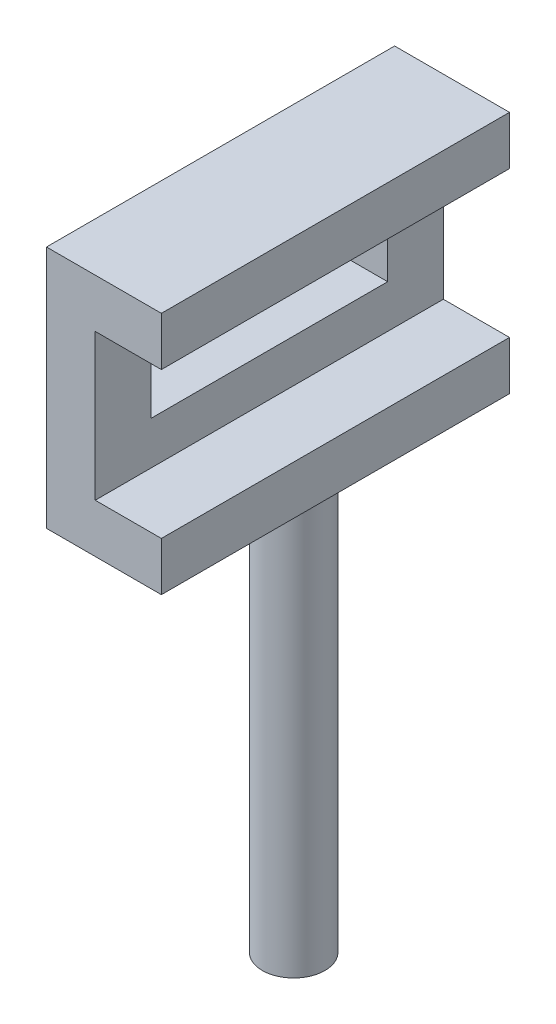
ISO-10303-21;
HEADER;
FILE_DESCRIPTION(('STEP AP214'),'2;1');
FILE_NAME('part.step','',(''),(''),'','','');
FILE_SCHEMA(('AUTOMOTIVE_DESIGN { 1 0 10303 214 1 1 1 1 }'));
ENDSEC;
DATA;
#1=APPLICATION_CONTEXT('core data for automotive mechanical design processes');
#2=APPLICATION_PROTOCOL_DEFINITION('international standard','automotive_design',2000,#1);
#3=PRODUCT_CONTEXT('',#1,'mechanical');
#4=PRODUCT('Part','Part','',(#3));
#5=PRODUCT_RELATED_PRODUCT_CATEGORY('part','',(#4));
#6=PRODUCT_DEFINITION_FORMATION('','',#4);
#7=PRODUCT_DEFINITION_CONTEXT('part definition',#1,'design');
#8=PRODUCT_DEFINITION('design','',#6,#7);
#9=PRODUCT_DEFINITION_SHAPE('','',#8);
#10=(LENGTH_UNIT() NAMED_UNIT(*) SI_UNIT(.MILLI.,.METRE.));
#11=(NAMED_UNIT(*) PLANE_ANGLE_UNIT() SI_UNIT($,.RADIAN.));
#12=(NAMED_UNIT(*) SI_UNIT($,.STERADIAN.) SOLID_ANGLE_UNIT());
#13=UNCERTAINTY_MEASURE_WITH_UNIT(LENGTH_MEASURE(1.E-05),#10,'distance_accuracy_value','');
#14=(GEOMETRIC_REPRESENTATION_CONTEXT(3) GLOBAL_UNCERTAINTY_ASSIGNED_CONTEXT((#13)) GLOBAL_UNIT_ASSIGNED_CONTEXT((#10,
#11,#12)) REPRESENTATION_CONTEXT('',''));
#15=CARTESIAN_POINT('',(0.,0.,0.));
#16=DIRECTION('',(0.,0.,1.));
#17=DIRECTION('',(1.,0.,0.));
#18=AXIS2_PLACEMENT_3D('',#15,#16,#17);
#19=CARTESIAN_POINT('',(-31.3967146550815,-12.2325806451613,50.));
#20=DIRECTION('',(0.,1.,0.));
#21=DIRECTION('',(-1.,0.,0.));
#22=AXIS2_PLACEMENT_3D('',#19,#20,#21);
#23=PLANE('',#22);
#24=DIRECTION('',(1.,0.,0.));
#25=VECTOR('',#24,1.);
#26=CARTESIAN_POINT('',(-31.3967146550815,-12.2325806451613,0.));
#27=LINE('',#26,#25);
#28=CARTESIAN_POINT('',(-47.8967146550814,-12.2325806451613,0.));
#29=VERTEX_POINT('',#28);
#30=CARTESIAN_POINT('',(-31.3967146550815,-12.2325806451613,0.));
#31=VERTEX_POINT('',#30);
#32=EDGE_CURVE('E181',#29,#31,#27,.T.);
#33=ORIENTED_EDGE('',*,*,#32,.T.);
#34=DIRECTION('',(0.,0.,-1.));
#35=VECTOR('',#34,1.);
#36=CARTESIAN_POINT('',(-31.3967146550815,-12.2325806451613,50.));
#37=LINE('',#36,#35);
#38=CARTESIAN_POINT('',(-31.3967146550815,-12.2325806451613,50.));
#39=VERTEX_POINT('',#38);
#40=EDGE_CURVE('E201',#39,#31,#37,.T.);
#41=ORIENTED_EDGE('',*,*,#40,.F.);
#42=DIRECTION('',(1.,0.,0.));
#43=VECTOR('',#42,1.);
#44=CARTESIAN_POINT('',(-31.3967146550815,-12.2325806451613,50.));
#45=LINE('',#44,#43);
#46=CARTESIAN_POINT('',(-47.8967146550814,-12.2325806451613,50.));
#47=VERTEX_POINT('',#46);
#48=EDGE_CURVE('E164',#47,#39,#45,.T.);
#49=ORIENTED_EDGE('',*,*,#48,.F.);
#50=DIRECTION('',(0.,0.,-1.));
#51=VECTOR('',#50,1.);
#52=CARTESIAN_POINT('',(-47.8967146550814,-12.2325806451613,50.));
#53=LINE('',#52,#51);
#54=EDGE_CURVE('E204',#47,#29,#53,.T.);
#55=ORIENTED_EDGE('',*,*,#54,.T.);
#56=EDGE_LOOP('',(#33,#41,#49,#55));
#57=FACE_BOUND('',#56,.T.);
#58=CARTESIAN_POINT('',(-37.3967146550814,-12.2325806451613,25.));
#59=DIRECTION('',(0.,1.,0.));
#60=DIRECTION('',(-1.,0.,0.));
#61=AXIS2_PLACEMENT_3D('',#58,#59,#60);
#62=CIRCLE('',#61,4.5);
#63=CARTESIAN_POINT('',(-41.8967146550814,-12.2325806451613,25.));
#64=VERTEX_POINT('',#63);
#65=EDGE_CURVE('E213',#64,#64,#62,.F.);
#66=ORIENTED_EDGE('',*,*,#65,.F.);
#67=EDGE_LOOP('',(#66));
#68=FACE_BOUND('',#67,.T.);
#69=ADVANCED_FACE('F35',(#57,#68),#23,.F.);
#70=CARTESIAN_POINT('',(-31.3967146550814,22.7674193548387,50.));
#71=DIRECTION('',(-1.,0.,0.));
#72=DIRECTION('',(0.,-1.,0.));
#73=AXIS2_PLACEMENT_3D('',#70,#71,#72);
#74=PLANE('',#73);
#75=DIRECTION('',(0.,1.,0.));
#76=VECTOR('',#75,1.);
#77=CARTESIAN_POINT('',(-31.3967146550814,22.7674193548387,0.));
#78=LINE('',#77,#76);
#79=CARTESIAN_POINT('',(-31.3967146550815,15.7674193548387,0.));
#80=VERTEX_POINT('',#79);
#81=CARTESIAN_POINT('',(-31.3967146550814,22.7674193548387,0.));
#82=VERTEX_POINT('',#81);
#83=EDGE_CURVE('E155',#80,#82,#78,.T.);
#84=ORIENTED_EDGE('',*,*,#83,.T.);
#85=DIRECTION('',(0.,0.,-1.));
#86=VECTOR('',#85,1.);
#87=CARTESIAN_POINT('',(-31.3967146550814,22.7674193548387,50.));
#88=LINE('',#87,#86);
#89=CARTESIAN_POINT('',(-31.3967146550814,22.7674193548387,50.));
#90=VERTEX_POINT('',#89);
#91=EDGE_CURVE('E210',#90,#82,#88,.T.);
#92=ORIENTED_EDGE('',*,*,#91,.F.);
#93=DIRECTION('',(0.,1.,0.));
#94=VECTOR('',#93,1.);
#95=CARTESIAN_POINT('',(-31.3967146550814,22.7674193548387,50.));
#96=LINE('',#95,#94);
#97=CARTESIAN_POINT('',(-31.3967146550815,15.7674193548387,50.));
#98=VERTEX_POINT('',#97);
#99=EDGE_CURVE('E156',#98,#90,#96,.T.);
#100=ORIENTED_EDGE('',*,*,#99,.F.);
#101=DIRECTION('',(0.,0.,-1.));
#102=VECTOR('',#101,1.);
#103=CARTESIAN_POINT('',(-31.3967146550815,15.7674193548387,50.));
#104=LINE('',#103,#102);
#105=EDGE_CURVE('E174',#98,#80,#104,.T.);
#106=ORIENTED_EDGE('',*,*,#105,.T.);
#107=EDGE_LOOP('',(#84,#92,#100,#106));
#108=FACE_BOUND('',#107,.T.);
#109=ADVANCED_FACE('F37',(#108),#74,.F.);
#110=CARTESIAN_POINT('',(-47.8967146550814,22.7674193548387,50.));
#111=DIRECTION('',(0.,-1.,0.));
#112=DIRECTION('',(0.,0.,-1.));
#113=AXIS2_PLACEMENT_3D('',#110,#111,#112);
#114=PLANE('',#113);
#115=DIRECTION('',(-1.,0.,0.));
#116=VECTOR('',#115,1.);
#117=CARTESIAN_POINT('',(-47.8967146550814,22.7674193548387,0.));
#118=LINE('',#117,#116);
#119=CARTESIAN_POINT('',(-47.8967146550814,22.7674193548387,0.));
#120=VERTEX_POINT('',#119);
#121=EDGE_CURVE('E177',#82,#120,#118,.T.);
#122=ORIENTED_EDGE('',*,*,#121,.T.);
#123=DIRECTION('',(0.,0.,-1.));
#124=VECTOR('',#123,1.);
#125=CARTESIAN_POINT('',(-47.8967146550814,22.7674193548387,50.));
#126=LINE('',#125,#124);
#127=CARTESIAN_POINT('',(-47.8967146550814,22.7674193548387,50.));
#128=VERTEX_POINT('',#127);
#129=EDGE_CURVE('E207',#128,#120,#126,.T.);
#130=ORIENTED_EDGE('',*,*,#129,.F.);
#131=DIRECTION('',(-1.,0.,0.));
#132=VECTOR('',#131,1.);
#133=CARTESIAN_POINT('',(-47.8967146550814,22.7674193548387,50.));
#134=LINE('',#133,#132);
#135=EDGE_CURVE('E159',#90,#128,#134,.T.);
#136=ORIENTED_EDGE('',*,*,#135,.F.);
#137=ORIENTED_EDGE('',*,*,#91,.T.);
#138=EDGE_LOOP('',(#122,#130,#136,#137));
#139=FACE_BOUND('',#138,.T.);
#140=ADVANCED_FACE('F244',(#139),#114,.F.);
#141=CARTESIAN_POINT('',(-47.8967146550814,-12.2325806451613,50.));
#142=DIRECTION('',(1.,0.,0.));
#143=DIRECTION('',(0.,0.,-1.));
#144=AXIS2_PLACEMENT_3D('',#141,#142,#143);
#145=PLANE('',#144);
#146=DIRECTION('',(0.,0.,1.));
#147=VECTOR('',#146,1.);
#148=CARTESIAN_POINT('',(-47.8967146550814,0.948713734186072,8.));
#149=LINE('',#148,#147);
#150=CARTESIAN_POINT('',(-47.8967146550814,0.948713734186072,8.));
#151=VERTEX_POINT('',#150);
#152=CARTESIAN_POINT('',(-47.8967146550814,0.948713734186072,42.));
#153=VERTEX_POINT('',#152);
#154=EDGE_CURVE('E136',#151,#153,#149,.T.);
#155=ORIENTED_EDGE('',*,*,#154,.F.);
#156=DIRECTION('',(0.,-1.,0.));
#157=VECTOR('',#156,1.);
#158=CARTESIAN_POINT('',(-47.8967146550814,10.9487137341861,8.));
#159=LINE('',#158,#157);
#160=CARTESIAN_POINT('',(-47.8967146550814,10.9487137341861,8.));
#161=VERTEX_POINT('',#160);
#162=EDGE_CURVE('E50',#161,#151,#159,.T.);
#163=ORIENTED_EDGE('',*,*,#162,.F.);
#164=DIRECTION('',(0.,0.,-1.));
#165=VECTOR('',#164,1.);
#166=CARTESIAN_POINT('',(-47.8967146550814,10.9487137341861,8.));
#167=LINE('',#166,#165);
#168=CARTESIAN_POINT('',(-47.8967146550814,10.9487137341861,42.));
#169=VERTEX_POINT('',#168);
#170=EDGE_CURVE('E143',#169,#161,#167,.T.);
#171=ORIENTED_EDGE('',*,*,#170,.F.);
#172=DIRECTION('',(0.,1.,0.));
#173=VECTOR('',#172,1.);
#174=CARTESIAN_POINT('',(-47.8967146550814,10.9487137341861,42.));
#175=LINE('',#174,#173);
#176=EDGE_CURVE('E127',#153,#169,#175,.T.);
#177=ORIENTED_EDGE('',*,*,#176,.F.);
#178=EDGE_LOOP('',(#155,#163,#171,#177));
#179=FACE_BOUND('',#178,.T.);
#180=DIRECTION('',(0.,-1.,0.));
#181=VECTOR('',#180,1.);
#182=CARTESIAN_POINT('',(-47.8967146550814,-12.2325806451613,0.));
#183=LINE('',#182,#181);
#184=EDGE_CURVE('E179',#120,#29,#183,.T.);
#185=ORIENTED_EDGE('',*,*,#184,.T.);
#186=ORIENTED_EDGE('',*,*,#54,.F.);
#187=DIRECTION('',(0.,-1.,0.));
#188=VECTOR('',#187,1.);
#189=CARTESIAN_POINT('',(-47.8967146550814,-12.2325806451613,50.));
#190=LINE('',#189,#188);
#191=EDGE_CURVE('E162',#128,#47,#190,.T.);
#192=ORIENTED_EDGE('',*,*,#191,.F.);
#193=ORIENTED_EDGE('',*,*,#129,.T.);
#194=EDGE_LOOP('',(#185,#186,#192,#193));
#195=FACE_BOUND('',#194,.T.);
#196=ADVANCED_FACE('F140',(#179,#195),#145,.F.);
#197=CARTESIAN_POINT('',(-31.3967146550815,-5.23258064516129,50.));
#198=DIRECTION('',(-1.,0.,0.));
#199=DIRECTION('',(0.,0.,1.));
#200=AXIS2_PLACEMENT_3D('',#197,#198,#199);
#201=PLANE('',#200);
#202=DIRECTION('',(0.,1.,0.));
#203=VECTOR('',#202,1.);
#204=CARTESIAN_POINT('',(-31.3967146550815,-5.23258064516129,0.));
#205=LINE('',#204,#203);
#206=CARTESIAN_POINT('',(-31.3967146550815,-5.23258064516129,0.));
#207=VERTEX_POINT('',#206);
#208=EDGE_CURVE('E183',#31,#207,#205,.T.);
#209=ORIENTED_EDGE('',*,*,#208,.T.);
#210=DIRECTION('',(0.,0.,-1.));
#211=VECTOR('',#210,1.);
#212=CARTESIAN_POINT('',(-31.3967146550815,-5.23258064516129,50.));
#213=LINE('',#212,#211);
#214=CARTESIAN_POINT('',(-31.3967146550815,-5.23258064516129,50.));
#215=VERTEX_POINT('',#214);
#216=EDGE_CURVE('E198',#215,#207,#213,.T.);
#217=ORIENTED_EDGE('',*,*,#216,.F.);
#218=DIRECTION('',(0.,1.,0.));
#219=VECTOR('',#218,1.);
#220=CARTESIAN_POINT('',(-31.3967146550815,-5.23258064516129,50.));
#221=LINE('',#220,#219);
#222=EDGE_CURVE('E166',#39,#215,#221,.T.);
#223=ORIENTED_EDGE('',*,*,#222,.F.);
#224=ORIENTED_EDGE('',*,*,#40,.T.);
#225=EDGE_LOOP('',(#209,#217,#223,#224));
#226=FACE_BOUND('',#225,.T.);
#227=ADVANCED_FACE('F249',(#226),#201,.F.);
#228=CARTESIAN_POINT('',(-40.8967146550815,-5.23258064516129,50.));
#229=DIRECTION('',(0.,-1.,0.));
#230=DIRECTION('',(0.,0.,-1.));
#231=AXIS2_PLACEMENT_3D('',#228,#229,#230);
#232=PLANE('',#231);
#233=DIRECTION('',(-1.,0.,0.));
#234=VECTOR('',#233,1.);
#235=CARTESIAN_POINT('',(-40.8967146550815,-5.23258064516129,0.));
#236=LINE('',#235,#234);
#237=CARTESIAN_POINT('',(-40.8967146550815,-5.23258064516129,0.));
#238=VERTEX_POINT('',#237);
#239=EDGE_CURVE('E185',#207,#238,#236,.T.);
#240=ORIENTED_EDGE('',*,*,#239,.T.);
#241=DIRECTION('',(0.,0.,-1.));
#242=VECTOR('',#241,1.);
#243=CARTESIAN_POINT('',(-40.8967146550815,-5.23258064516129,50.));
#244=LINE('',#243,#242);
#245=CARTESIAN_POINT('',(-40.8967146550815,-5.23258064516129,50.));
#246=VERTEX_POINT('',#245);
#247=EDGE_CURVE('E195',#246,#238,#244,.T.);
#248=ORIENTED_EDGE('',*,*,#247,.F.);
#249=DIRECTION('',(-1.,0.,0.));
#250=VECTOR('',#249,1.);
#251=CARTESIAN_POINT('',(-40.8967146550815,-5.23258064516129,50.));
#252=LINE('',#251,#250);
#253=EDGE_CURVE('E168',#215,#246,#252,.T.);
#254=ORIENTED_EDGE('',*,*,#253,.F.);
#255=ORIENTED_EDGE('',*,*,#216,.T.);
#256=EDGE_LOOP('',(#240,#248,#254,#255));
#257=FACE_BOUND('',#256,.T.);
#258=ADVANCED_FACE('F286',(#257),#232,.F.);
#259=CARTESIAN_POINT('',(-40.8967146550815,15.7674193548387,50.));
#260=DIRECTION('',(-1.,0.,0.));
#261=DIRECTION('',(0.,0.,1.));
#262=AXIS2_PLACEMENT_3D('',#259,#260,#261);
#263=PLANE('',#262);
#264=DIRECTION('',(0.,0.,-1.));
#265=VECTOR('',#264,1.);
#266=CARTESIAN_POINT('',(-40.8967146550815,10.9487137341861,50.));
#267=LINE('',#266,#265);
#268=CARTESIAN_POINT('',(-40.8967146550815,10.9487137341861,42.));
#269=VERTEX_POINT('',#268);
#270=CARTESIAN_POINT('',(-40.8967146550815,10.9487137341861,8.));
#271=VERTEX_POINT('',#270);
#272=EDGE_CURVE('E43',#269,#271,#267,.T.);
#273=ORIENTED_EDGE('',*,*,#272,.T.);
#274=DIRECTION('',(0.,-1.,0.));
#275=VECTOR('',#274,1.);
#276=CARTESIAN_POINT('',(-40.8967146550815,15.7674193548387,8.));
#277=LINE('',#276,#275);
#278=CARTESIAN_POINT('',(-40.8967146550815,0.948713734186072,8.));
#279=VERTEX_POINT('',#278);
#280=EDGE_CURVE('E11',#271,#279,#277,.T.);
#281=ORIENTED_EDGE('',*,*,#280,.T.);
#282=DIRECTION('',(0.,0.,1.));
#283=VECTOR('',#282,1.);
#284=CARTESIAN_POINT('',(-40.8967146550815,0.948713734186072,50.));
#285=LINE('',#284,#283);
#286=CARTESIAN_POINT('',(-40.8967146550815,0.948713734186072,42.));
#287=VERTEX_POINT('',#286);
#288=EDGE_CURVE('E216',#279,#287,#285,.T.);
#289=ORIENTED_EDGE('',*,*,#288,.T.);
#290=DIRECTION('',(0.,1.,0.));
#291=VECTOR('',#290,1.);
#292=CARTESIAN_POINT('',(-40.8967146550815,15.7674193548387,42.));
#293=LINE('',#292,#291);
#294=EDGE_CURVE('E130',#287,#269,#293,.T.);
#295=ORIENTED_EDGE('',*,*,#294,.T.);
#296=EDGE_LOOP('',(#273,#281,#289,#295));
#297=FACE_BOUND('',#296,.T.);
#298=DIRECTION('',(0.,1.,0.));
#299=VECTOR('',#298,1.);
#300=CARTESIAN_POINT('',(-40.8967146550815,15.7674193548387,0.));
#301=LINE('',#300,#299);
#302=CARTESIAN_POINT('',(-40.8967146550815,15.7674193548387,0.));
#303=VERTEX_POINT('',#302);
#304=EDGE_CURVE('E187',#238,#303,#301,.T.);
#305=ORIENTED_EDGE('',*,*,#304,.T.);
#306=DIRECTION('',(0.,0.,-1.));
#307=VECTOR('',#306,1.);
#308=CARTESIAN_POINT('',(-40.8967146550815,15.7674193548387,50.));
#309=LINE('',#308,#307);
#310=CARTESIAN_POINT('',(-40.8967146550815,15.7674193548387,50.));
#311=VERTEX_POINT('',#310);
#312=EDGE_CURVE('E192',#311,#303,#309,.T.);
#313=ORIENTED_EDGE('',*,*,#312,.F.);
#314=DIRECTION('',(0.,1.,0.));
#315=VECTOR('',#314,1.);
#316=CARTESIAN_POINT('',(-40.8967146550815,15.7674193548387,50.));
#317=LINE('',#316,#315);
#318=EDGE_CURVE('E170',#246,#311,#317,.T.);
#319=ORIENTED_EDGE('',*,*,#318,.F.);
#320=ORIENTED_EDGE('',*,*,#247,.T.);
#321=EDGE_LOOP('',(#305,#313,#319,#320));
#322=FACE_BOUND('',#321,.T.);
#323=ADVANCED_FACE('F220',(#297,#322),#263,.F.);
#324=CARTESIAN_POINT('',(-31.3967146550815,15.7674193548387,50.));
#325=DIRECTION('',(0.,1.,0.));
#326=DIRECTION('',(0.,0.,1.));
#327=AXIS2_PLACEMENT_3D('',#324,#325,#326);
#328=PLANE('',#327);
#329=DIRECTION('',(1.,0.,0.));
#330=VECTOR('',#329,1.);
#331=CARTESIAN_POINT('',(-31.3967146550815,15.7674193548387,0.));
#332=LINE('',#331,#330);
#333=EDGE_CURVE('E160',#303,#80,#332,.T.);
#334=ORIENTED_EDGE('',*,*,#333,.T.);
#335=ORIENTED_EDGE('',*,*,#105,.F.);
#336=DIRECTION('',(1.,0.,0.));
#337=VECTOR('',#336,1.);
#338=CARTESIAN_POINT('',(-31.3967146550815,15.7674193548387,50.));
#339=LINE('',#338,#337);
#340=EDGE_CURVE('E172',#311,#98,#339,.T.);
#341=ORIENTED_EDGE('',*,*,#340,.F.);
#342=ORIENTED_EDGE('',*,*,#312,.T.);
#343=EDGE_LOOP('',(#334,#335,#341,#342));
#344=FACE_BOUND('',#343,.T.);
#345=ADVANCED_FACE('F282',(#344),#328,.F.);
#346=CARTESIAN_POINT('',(0.,0.,50.));
#347=DIRECTION('',(0.,0.,-1.));
#348=DIRECTION('',(-1.,0.,0.));
#349=AXIS2_PLACEMENT_3D('',#346,#347,#348);
#350=PLANE('',#349);
#351=ORIENTED_EDGE('',*,*,#99,.T.);
#352=ORIENTED_EDGE('',*,*,#135,.T.);
#353=ORIENTED_EDGE('',*,*,#191,.T.);
#354=ORIENTED_EDGE('',*,*,#48,.T.);
#355=ORIENTED_EDGE('',*,*,#222,.T.);
#356=ORIENTED_EDGE('',*,*,#253,.T.);
#357=ORIENTED_EDGE('',*,*,#318,.T.);
#358=ORIENTED_EDGE('',*,*,#340,.T.);
#359=EDGE_LOOP('',(#351,#352,#353,#354,#355,#356,#357,#358));
#360=FACE_BOUND('',#359,.T.);
#361=ADVANCED_FACE('F274',(#360),#350,.F.);
#362=CARTESIAN_POINT('',(0.,0.,0.));
#363=DIRECTION('',(0.,0.,-1.));
#364=DIRECTION('',(-1.,0.,0.));
#365=AXIS2_PLACEMENT_3D('',#362,#363,#364);
#366=PLANE('',#365);
#367=ORIENTED_EDGE('',*,*,#83,.F.);
#368=ORIENTED_EDGE('',*,*,#333,.F.);
#369=ORIENTED_EDGE('',*,*,#304,.F.);
#370=ORIENTED_EDGE('',*,*,#239,.F.);
#371=ORIENTED_EDGE('',*,*,#208,.F.);
#372=ORIENTED_EDGE('',*,*,#32,.F.);
#373=ORIENTED_EDGE('',*,*,#184,.F.);
#374=ORIENTED_EDGE('',*,*,#121,.F.);
#375=EDGE_LOOP('',(#367,#368,#369,#370,#371,#372,#373,#374));
#376=FACE_BOUND('',#375,.T.);
#377=ADVANCED_FACE('F264',(#376),#366,.T.);
#378=CARTESIAN_POINT('',(-37.3967146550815,-72.2325806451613,25.));
#379=DIRECTION('',(0.,1.,0.));
#380=DIRECTION('',(-1.,0.,0.));
#381=AXIS2_PLACEMENT_3D('',#378,#379,#380);
#382=CYLINDRICAL_SURFACE('',#381,4.5);
#383=CARTESIAN_POINT('',(-37.3967146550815,-72.2325806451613,25.));
#384=DIRECTION('',(0.,-1.,0.));
#385=DIRECTION('',(1.,0.,0.));
#386=AXIS2_PLACEMENT_3D('',#383,#384,#385);
#387=CIRCLE('',#386,4.5);
#388=CARTESIAN_POINT('',(-32.8967146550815,-72.2325806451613,25.));
#389=VERTEX_POINT('',#388);
#390=EDGE_CURVE('E150',#389,#389,#387,.T.);
#391=ORIENTED_EDGE('',*,*,#390,.F.);
#392=EDGE_LOOP('',(#391));
#393=FACE_BOUND('',#392,.T.);
#394=ORIENTED_EDGE('',*,*,#65,.T.);
#395=EDGE_LOOP('',(#394));
#396=FACE_BOUND('',#395,.T.);
#397=ADVANCED_FACE('F234',(#393,#396),#382,.T.);
#398=CARTESIAN_POINT('',(-37.3967146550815,-72.2325806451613,25.));
#399=DIRECTION('',(0.,-1.,0.));
#400=DIRECTION('',(1.,0.,0.));
#401=AXIS2_PLACEMENT_3D('',#398,#399,#400);
#402=PLANE('',#401);
#403=ORIENTED_EDGE('',*,*,#390,.T.);
#404=EDGE_LOOP('',(#403));
#405=FACE_BOUND('',#404,.T.);
#406=ADVANCED_FACE('F227',(#405),#402,.T.);
#407=CARTESIAN_POINT('',(12.1032853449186,10.9487137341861,8.));
#408=DIRECTION('',(0.,0.,-1.));
#409=DIRECTION('',(-1.,0.,0.));
#410=AXIS2_PLACEMENT_3D('',#407,#408,#409);
#411=PLANE('',#410);
#412=DIRECTION('',(-1.,0.,0.));
#413=VECTOR('',#412,1.);
#414=CARTESIAN_POINT('',(12.1032853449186,10.9487137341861,8.));
#415=LINE('',#414,#413);
#416=EDGE_CURVE('E148',#271,#161,#415,.T.);
#417=ORIENTED_EDGE('',*,*,#416,.T.);
#418=ORIENTED_EDGE('',*,*,#162,.T.);
#419=DIRECTION('',(-1.,0.,0.));
#420=VECTOR('',#419,1.);
#421=CARTESIAN_POINT('',(12.1032853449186,0.948713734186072,8.));
#422=LINE('',#421,#420);
#423=EDGE_CURVE('E133',#279,#151,#422,.T.);
#424=ORIENTED_EDGE('',*,*,#423,.F.);
#425=ORIENTED_EDGE('',*,*,#280,.F.);
#426=EDGE_LOOP('',(#417,#418,#424,#425));
#427=FACE_BOUND('',#426,.T.);
#428=ADVANCED_FACE('F225',(#427),#411,.F.);
#429=CARTESIAN_POINT('',(12.1032853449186,10.9487137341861,8.));
#430=DIRECTION('',(0.,1.,0.));
#431=DIRECTION('',(0.,0.,1.));
#432=AXIS2_PLACEMENT_3D('',#429,#430,#431);
#433=PLANE('',#432);
#434=DIRECTION('',(-1.,0.,0.));
#435=VECTOR('',#434,1.);
#436=CARTESIAN_POINT('',(12.1032853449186,10.9487137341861,42.));
#437=LINE('',#436,#435);
#438=EDGE_CURVE('E132',#269,#169,#437,.T.);
#439=ORIENTED_EDGE('',*,*,#438,.T.);
#440=ORIENTED_EDGE('',*,*,#170,.T.);
#441=ORIENTED_EDGE('',*,*,#416,.F.);
#442=ORIENTED_EDGE('',*,*,#272,.F.);
#443=EDGE_LOOP('',(#439,#440,#441,#442));
#444=FACE_BOUND('',#443,.T.);
#445=ADVANCED_FACE('F224',(#444),#433,.F.);
#446=CARTESIAN_POINT('',(12.1032853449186,10.9487137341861,42.));
#447=DIRECTION('',(0.,0.,1.));
#448=DIRECTION('',(0.,-1.,0.));
#449=AXIS2_PLACEMENT_3D('',#446,#447,#448);
#450=PLANE('',#449);
#451=DIRECTION('',(-1.,0.,0.));
#452=VECTOR('',#451,1.);
#453=CARTESIAN_POINT('',(12.1032853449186,0.948713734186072,42.));
#454=LINE('',#453,#452);
#455=EDGE_CURVE('E58',#287,#153,#454,.T.);
#456=ORIENTED_EDGE('',*,*,#455,.T.);
#457=ORIENTED_EDGE('',*,*,#176,.T.);
#458=ORIENTED_EDGE('',*,*,#438,.F.);
#459=ORIENTED_EDGE('',*,*,#294,.F.);
#460=EDGE_LOOP('',(#456,#457,#458,#459));
#461=FACE_BOUND('',#460,.T.);
#462=ADVANCED_FACE('F124',(#461),#450,.F.);
#463=CARTESIAN_POINT('',(12.1032853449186,0.948713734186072,8.));
#464=DIRECTION('',(0.,-1.,0.));
#465=DIRECTION('',(0.,0.,-1.));
#466=AXIS2_PLACEMENT_3D('',#463,#464,#465);
#467=PLANE('',#466);
#468=ORIENTED_EDGE('',*,*,#423,.T.);
#469=ORIENTED_EDGE('',*,*,#154,.T.);
#470=ORIENTED_EDGE('',*,*,#455,.F.);
#471=ORIENTED_EDGE('',*,*,#288,.F.);
#472=EDGE_LOOP('',(#468,#469,#470,#471));
#473=FACE_BOUND('',#472,.T.);
#474=ADVANCED_FACE('F137',(#473),#467,.F.);
#475=CLOSED_SHELL('',(#69,#109,#140,#196,#227,#258,#323,#345,#361,#377,#397,#406,#428,#445,#462,#474));
#476=MANIFOLD_SOLID_BREP('B2',#475);
#477=ADVANCED_BREP_SHAPE_REPRESENTATION('',(#18,#476),#14);
#478=SHAPE_DEFINITION_REPRESENTATION(#9,#477);
ENDSEC;
END-ISO-10303-21;
